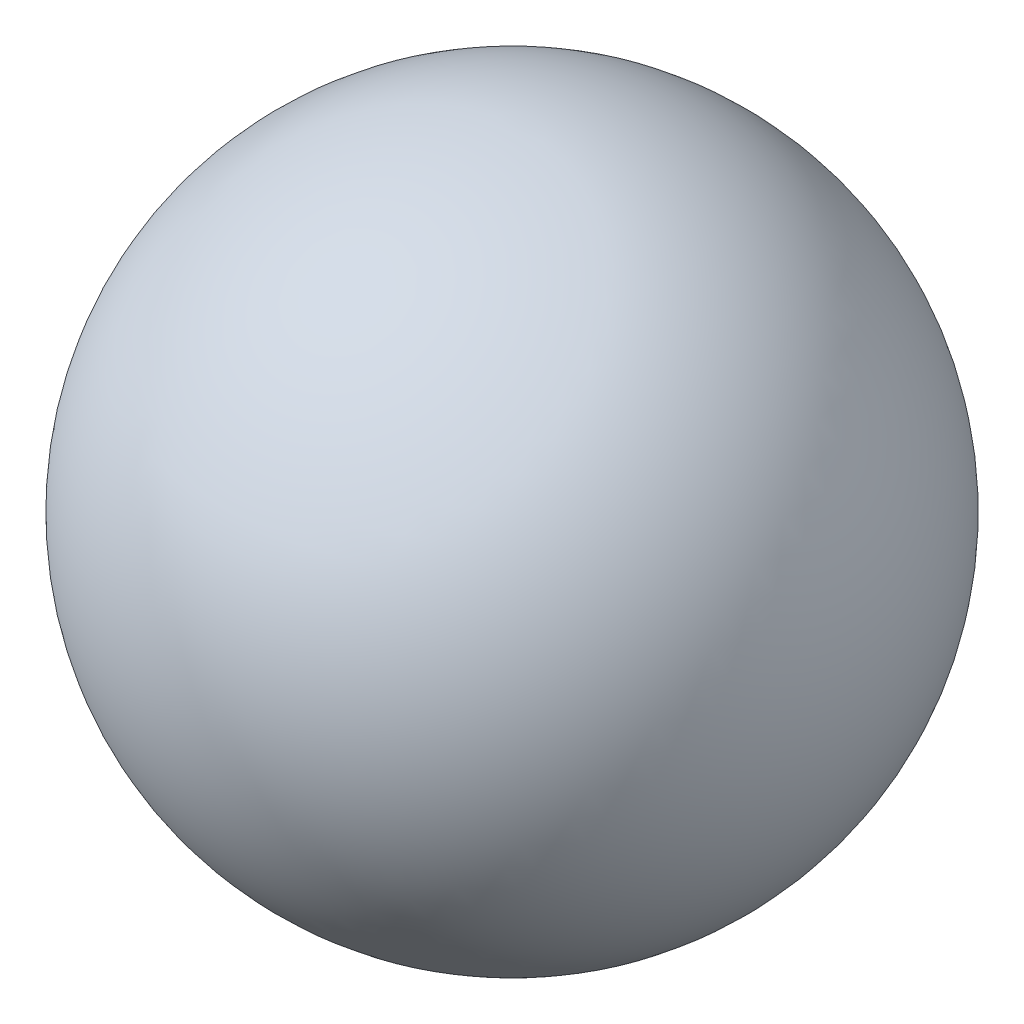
from build123d import *


with BuildPart() as part:
    # Esquisse1 → Base-R_volution (revolve)
    with BuildSketch(Plane.XY):
        with BuildLine():
            Line((0, 2.5), (0, -2.5))
            ThreePointArc((0, -2.5), (2.5, 0), (0, 2.5))
        make_face()
    revolve(axis=Axis((0, 27.927363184, 0), (0, -1, 0)))


solid = part.part
